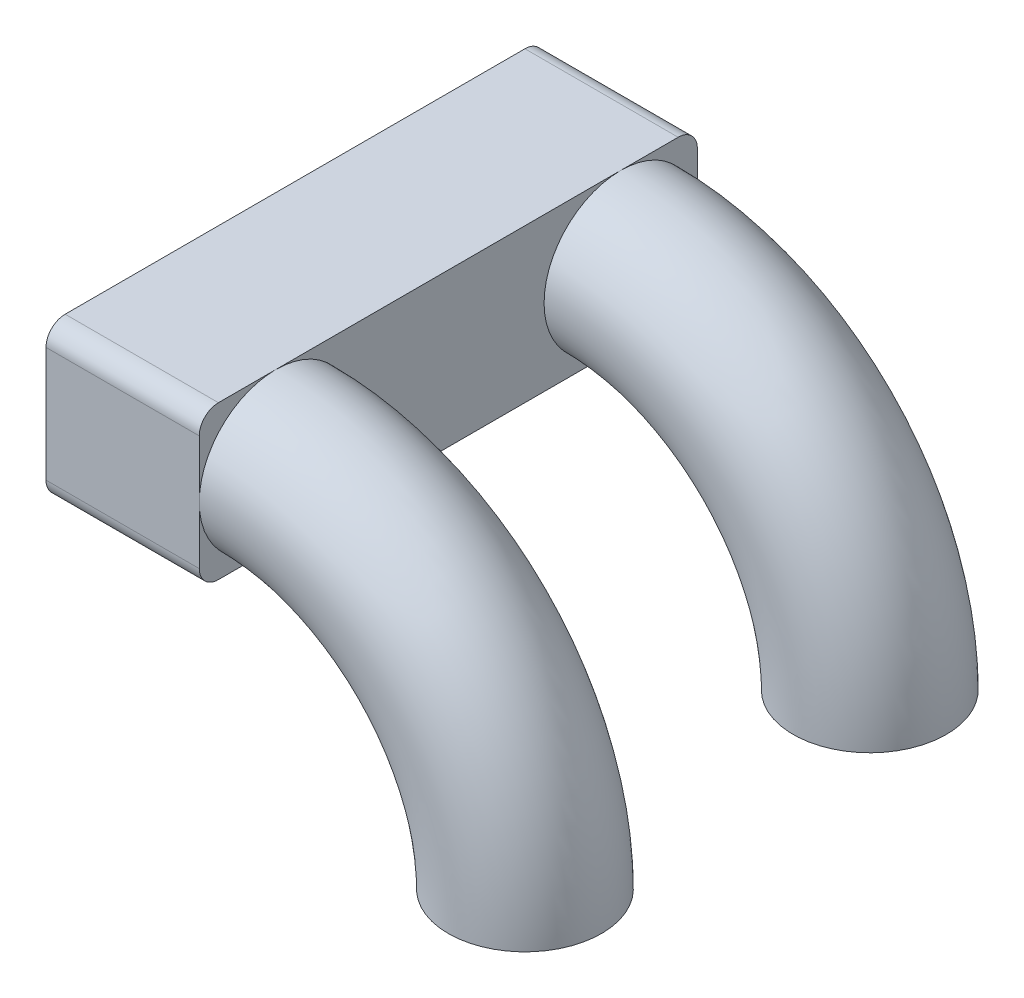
from build123d import *

# Parameters (mm, degrees)
SKETCH1_W           = 40
SKETCH1_H           = 40
BOSS_EXTRUDE1_DEPTH = 65
FILLET1_R           = 5
SHELL1_T            = 2
SKETCH7_R           = 20
SKETCH8_R           = 18


with BuildPart() as part:
    # Sketch1 → Boss-Extrude1 (new, symmetric)
    with BuildSketch(Plane.XY):
        Rectangle(SKETCH1_W, SKETCH1_H)
    extrude(amount=BOSS_EXTRUDE1_DEPTH, both=True)

    # Fillet1
    fillet1_edges = [part.edges().sort_by_distance(p)[0] for p in [
        (0, -20, 65),
        (0, -20, -65),
        (0, 20, -65),
        (0, 20, 65),
    ]]
    fillet(fillet1_edges, radius=FILLET1_R)

    # Shell1 (no face opened: a closed hollow body)
    add(offset(amount=-SHELL1_T, mode=Mode.PRIVATE), mode=Mode.SUBTRACT)

    # Sweep1: sweep along a path in Sketch2
    with BuildLine(Plane.XY) as sweep1_path:
        ThreePointArc((20, 0), (65.961940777, -19.038059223), (85, -65))
    # Sketch7 → Sweep1 (sweep)
    with BuildSketch(Plane(origin=(20, 0, 0), x_dir=(0, 0, -1), z_dir=(1, 0, 0))):
        with Locations((45, 0)):
            Circle(SKETCH7_R)
    sweep1 = sweep(path=sweep1_path.line)

    # Cut-Sweep1: sweep along a path in Sketch2_2
    with BuildLine(Plane.XY) as cut_sweep1_path:
        Line((0.110853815, 0), (20, 0))
        ThreePointArc((20, 0), (65.961940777, -19.038059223), (85, -65))
    # Sketch8 → Cut-Sweep1 (sweep, cut)
    with BuildSketch(Plane.XZ.offset(65)):
        with Locations((85, -45)):
            Circle(SKETCH8_R)
    cut_sweep1 = sweep(path=cut_sweep1_path.line, mode=Mode.SUBTRACT)

    # Mirror1: Sweep1, Cut-Sweep1 across plane
    add(sweep1.mirror(Plane.XY))
    add(cut_sweep1.mirror(Plane.XY), mode=Mode.SUBTRACT)


solid = part.part
